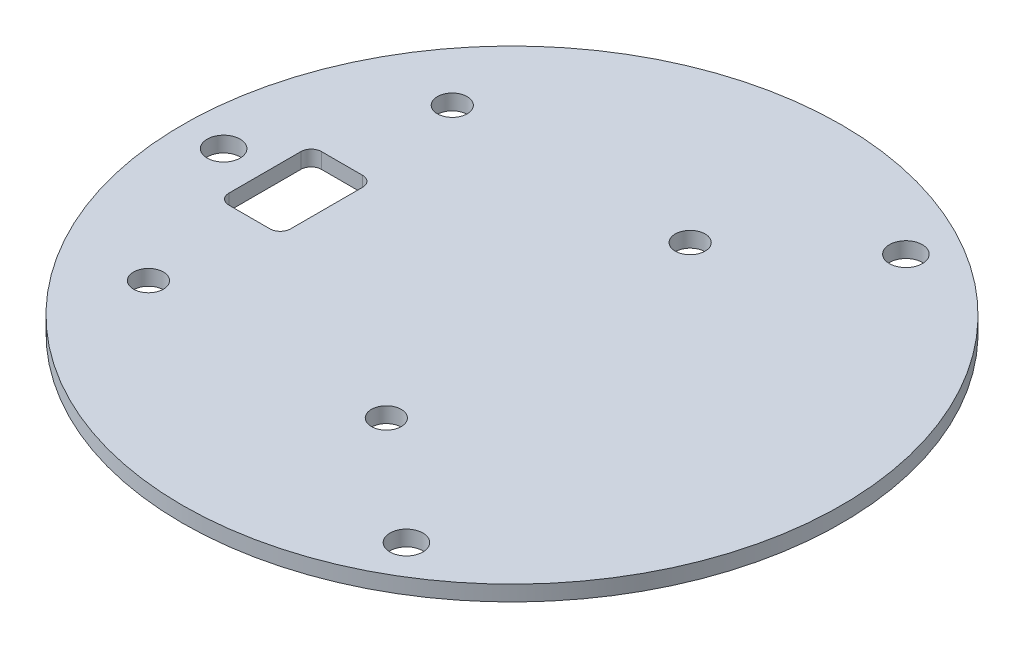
ISO-10303-21;
HEADER;
FILE_DESCRIPTION(('STEP AP214'),'2;1');
FILE_NAME('part.step','',(''),(''),'','','');
FILE_SCHEMA(('AUTOMOTIVE_DESIGN { 1 0 10303 214 1 1 1 1 }'));
ENDSEC;
DATA;
#1=APPLICATION_CONTEXT('core data for automotive mechanical design processes');
#2=APPLICATION_PROTOCOL_DEFINITION('international standard','automotive_design',2000,#1);
#3=PRODUCT_CONTEXT('',#1,'mechanical');
#4=PRODUCT('Part','Part','',(#3));
#5=PRODUCT_RELATED_PRODUCT_CATEGORY('part','',(#4));
#6=PRODUCT_DEFINITION_FORMATION('','',#4);
#7=PRODUCT_DEFINITION_CONTEXT('part definition',#1,'design');
#8=PRODUCT_DEFINITION('design','',#6,#7);
#9=PRODUCT_DEFINITION_SHAPE('','',#8);
#10=(LENGTH_UNIT() NAMED_UNIT(*) SI_UNIT(.MILLI.,.METRE.));
#11=(NAMED_UNIT(*) PLANE_ANGLE_UNIT() SI_UNIT($,.RADIAN.));
#12=(NAMED_UNIT(*) SI_UNIT($,.STERADIAN.) SOLID_ANGLE_UNIT());
#13=UNCERTAINTY_MEASURE_WITH_UNIT(LENGTH_MEASURE(1.E-05),#10,'distance_accuracy_value','');
#14=(GEOMETRIC_REPRESENTATION_CONTEXT(3) GLOBAL_UNCERTAINTY_ASSIGNED_CONTEXT((#13)) GLOBAL_UNIT_ASSIGNED_CONTEXT((#10,
#11,#12)) REPRESENTATION_CONTEXT('',''));
#15=CARTESIAN_POINT('',(0.,0.,0.));
#16=DIRECTION('',(0.,0.,1.));
#17=DIRECTION('',(1.,0.,0.));
#18=AXIS2_PLACEMENT_3D('',#15,#16,#17);
#19=CARTESIAN_POINT('',(0.,-1.5,0.));
#20=DIRECTION('',(0.,1.,0.));
#21=DIRECTION('',(0.,0.,1.));
#22=AXIS2_PLACEMENT_3D('',#19,#20,#21);
#23=CYLINDRICAL_SURFACE('',#22,32.);
#24=CARTESIAN_POINT('',(0.,-1.5,0.));
#25=DIRECTION('',(0.,1.,0.));
#26=DIRECTION('',(0.,0.,1.));
#27=AXIS2_PLACEMENT_3D('',#24,#25,#26);
#28=CIRCLE('',#27,32.);
#29=CARTESIAN_POINT('',(0.,-1.5,32.));
#30=VERTEX_POINT('',#29);
#31=EDGE_CURVE('E171',#30,#30,#28,.T.);
#32=ORIENTED_EDGE('',*,*,#31,.T.);
#33=EDGE_LOOP('',(#32));
#34=FACE_BOUND('',#33,.T.);
#35=CARTESIAN_POINT('',(0.,0.,0.));
#36=DIRECTION('',(0.,1.,0.));
#37=DIRECTION('',(0.,0.,1.));
#38=AXIS2_PLACEMENT_3D('',#35,#36,#37);
#39=CIRCLE('',#38,32.);
#40=CARTESIAN_POINT('',(0.,0.,32.));
#41=VERTEX_POINT('',#40);
#42=EDGE_CURVE('E155',#41,#41,#39,.T.);
#43=ORIENTED_EDGE('',*,*,#42,.F.);
#44=EDGE_LOOP('',(#43));
#45=FACE_BOUND('',#44,.T.);
#46=ADVANCED_FACE('F49',(#34,#45),#23,.T.);
#47=CARTESIAN_POINT('',(0.,-1.5,0.));
#48=DIRECTION('',(0.,1.,0.));
#49=DIRECTION('',(0.,0.,1.));
#50=AXIS2_PLACEMENT_3D('',#47,#48,#49);
#51=PLANE('',#50);
#52=CARTESIAN_POINT('',(-20.55,-1.5,-14.75));
#53=DIRECTION('',(0.,-1.,0.));
#54=DIRECTION('',(0.,0.,-1.));
#55=AXIS2_PLACEMENT_3D('',#52,#53,#54);
#56=CIRCLE('',#55,1.45);
#57=CARTESIAN_POINT('',(-20.55,-1.5,-16.2));
#58=VERTEX_POINT('',#57);
#59=EDGE_CURVE('E228',#58,#58,#56,.T.);
#60=ORIENTED_EDGE('',*,*,#59,.F.);
#61=EDGE_LOOP('',(#60));
#62=FACE_BOUND('',#61,.T.);
#63=CARTESIAN_POINT('',(-20.55,-1.5,14.75));
#64=DIRECTION('',(0.,-1.,0.));
#65=DIRECTION('',(0.,0.,-1.));
#66=AXIS2_PLACEMENT_3D('',#63,#64,#65);
#67=CIRCLE('',#66,1.45);
#68=CARTESIAN_POINT('',(-20.55,-1.5,13.3));
#69=VERTEX_POINT('',#68);
#70=EDGE_CURVE('E234',#69,#69,#67,.T.);
#71=ORIENTED_EDGE('',*,*,#70,.F.);
#72=EDGE_LOOP('',(#71));
#73=FACE_BOUND('',#72,.T.);
#74=CARTESIAN_POINT('',(2.55,-1.5,14.75));
#75=DIRECTION('',(0.,-1.,0.));
#76=DIRECTION('',(0.,0.,-1.));
#77=AXIS2_PLACEMENT_3D('',#74,#75,#76);
#78=CIRCLE('',#77,1.45);
#79=CARTESIAN_POINT('',(2.55,-1.5,13.3));
#80=VERTEX_POINT('',#79);
#81=EDGE_CURVE('E222',#80,#80,#78,.T.);
#82=ORIENTED_EDGE('',*,*,#81,.F.);
#83=EDGE_LOOP('',(#82));
#84=FACE_BOUND('',#83,.T.);
#85=CARTESIAN_POINT('',(2.55,-1.5,-14.75));
#86=DIRECTION('',(0.,-1.,0.));
#87=DIRECTION('',(0.,0.,-1.));
#88=AXIS2_PLACEMENT_3D('',#85,#86,#87);
#89=CIRCLE('',#88,1.45);
#90=CARTESIAN_POINT('',(2.55,-1.5,-16.2));
#91=VERTEX_POINT('',#90);
#92=EDGE_CURVE('E217',#91,#91,#89,.T.);
#93=ORIENTED_EDGE('',*,*,#92,.F.);
#94=EDGE_LOOP('',(#93));
#95=FACE_BOUND('',#94,.T.);
#96=DIRECTION('',(0.,0.,1.));
#97=VECTOR('',#96,1.);
#98=CARTESIAN_POINT('',(-24.,-1.5,-4.5));
#99=LINE('',#98,#97);
#100=CARTESIAN_POINT('',(-24.,-1.5,-3.5));
#101=VERTEX_POINT('',#100);
#102=CARTESIAN_POINT('',(-24.,-1.5,3.5));
#103=VERTEX_POINT('',#102);
#104=EDGE_CURVE('E205',#101,#103,#99,.T.);
#105=ORIENTED_EDGE('',*,*,#104,.T.);
#106=CARTESIAN_POINT('',(-23.,-1.5,3.5));
#107=DIRECTION('',(0.,1.,0.));
#108=DIRECTION('',(0.,0.,1.));
#109=AXIS2_PLACEMENT_3D('',#106,#107,#108);
#110=CIRCLE('',#109,1.);
#111=CARTESIAN_POINT('',(-23.,-1.5,4.5));
#112=VERTEX_POINT('',#111);
#113=EDGE_CURVE('E125',#103,#112,#110,.T.);
#114=ORIENTED_EDGE('',*,*,#113,.T.);
#115=DIRECTION('',(1.,0.,0.));
#116=VECTOR('',#115,1.);
#117=CARTESIAN_POINT('',(-18.,-1.5,4.5));
#118=LINE('',#117,#116);
#119=CARTESIAN_POINT('',(-19.,-1.5,4.5));
#120=VERTEX_POINT('',#119);
#121=EDGE_CURVE('E135',#112,#120,#118,.T.);
#122=ORIENTED_EDGE('',*,*,#121,.T.);
#123=CARTESIAN_POINT('',(-19.,-1.5,3.5));
#124=DIRECTION('',(0.,1.,0.));
#125=DIRECTION('',(0.,0.,1.));
#126=AXIS2_PLACEMENT_3D('',#123,#124,#125);
#127=CIRCLE('',#126,1.);
#128=CARTESIAN_POINT('',(-18.,-1.5,3.5));
#129=VERTEX_POINT('',#128);
#130=EDGE_CURVE('E190',#120,#129,#127,.T.);
#131=ORIENTED_EDGE('',*,*,#130,.T.);
#132=DIRECTION('',(0.,0.,-1.));
#133=VECTOR('',#132,1.);
#134=CARTESIAN_POINT('',(-18.,-1.5,-4.5));
#135=LINE('',#134,#133);
#136=CARTESIAN_POINT('',(-18.,-1.5,-3.5));
#137=VERTEX_POINT('',#136);
#138=EDGE_CURVE('E143',#129,#137,#135,.T.);
#139=ORIENTED_EDGE('',*,*,#138,.T.);
#140=CARTESIAN_POINT('',(-19.,-1.5,-3.5));
#141=DIRECTION('',(0.,1.,0.));
#142=DIRECTION('',(0.,0.,1.));
#143=AXIS2_PLACEMENT_3D('',#140,#141,#142);
#144=CIRCLE('',#143,1.);
#145=CARTESIAN_POINT('',(-19.,-1.5,-4.5));
#146=VERTEX_POINT('',#145);
#147=EDGE_CURVE('E71',#137,#146,#144,.T.);
#148=ORIENTED_EDGE('',*,*,#147,.T.);
#149=DIRECTION('',(-1.,0.,0.));
#150=VECTOR('',#149,1.);
#151=CARTESIAN_POINT('',(-18.,-1.5,-4.5));
#152=LINE('',#151,#150);
#153=CARTESIAN_POINT('',(-23.,-1.5,-4.5));
#154=VERTEX_POINT('',#153);
#155=EDGE_CURVE('E146',#146,#154,#152,.T.);
#156=ORIENTED_EDGE('',*,*,#155,.T.);
#157=CARTESIAN_POINT('',(-23.,-1.5,-3.5));
#158=DIRECTION('',(0.,1.,0.));
#159=DIRECTION('',(0.,0.,1.));
#160=AXIS2_PLACEMENT_3D('',#157,#158,#159);
#161=CIRCLE('',#160,1.);
#162=EDGE_CURVE('E11',#154,#101,#161,.T.);
#163=ORIENTED_EDGE('',*,*,#162,.T.);
#164=EDGE_LOOP('',(#105,#114,#122,#131,#139,#148,#156,#163));
#165=FACE_BOUND('',#164,.T.);
#166=CARTESIAN_POINT('',(-28.,-1.5,0.));
#167=DIRECTION('',(0.,1.,0.));
#168=DIRECTION('',(0.,0.,1.));
#169=AXIS2_PLACEMENT_3D('',#166,#167,#168);
#170=CIRCLE('',#169,1.6);
#171=CARTESIAN_POINT('',(-28.,-1.5,1.6));
#172=VERTEX_POINT('',#171);
#173=EDGE_CURVE('E152',#172,#172,#170,.T.);
#174=ORIENTED_EDGE('',*,*,#173,.T.);
#175=EDGE_LOOP('',(#174));
#176=FACE_BOUND('',#175,.T.);
#177=CARTESIAN_POINT('',(14.,-1.5,-24.2487113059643));
#178=DIRECTION('',(0.,1.,0.));
#179=DIRECTION('',(0.,0.,1.));
#180=AXIS2_PLACEMENT_3D('',#177,#178,#179);
#181=CIRCLE('',#180,1.6);
#182=CARTESIAN_POINT('',(14.,-1.5,-22.6487113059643));
#183=VERTEX_POINT('',#182);
#184=EDGE_CURVE('E162',#183,#183,#181,.T.);
#185=ORIENTED_EDGE('',*,*,#184,.T.);
#186=EDGE_LOOP('',(#185));
#187=FACE_BOUND('',#186,.T.);
#188=CARTESIAN_POINT('',(14.,-1.5,24.2487113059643));
#189=DIRECTION('',(0.,1.,0.));
#190=DIRECTION('',(0.,0.,1.));
#191=AXIS2_PLACEMENT_3D('',#188,#189,#190);
#192=CIRCLE('',#191,1.6);
#193=CARTESIAN_POINT('',(14.,-1.5,25.8487113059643));
#194=VERTEX_POINT('',#193);
#195=EDGE_CURVE('E168',#194,#194,#192,.T.);
#196=ORIENTED_EDGE('',*,*,#195,.T.);
#197=EDGE_LOOP('',(#196));
#198=FACE_BOUND('',#197,.T.);
#199=ORIENTED_EDGE('',*,*,#31,.F.);
#200=EDGE_LOOP('',(#199));
#201=FACE_BOUND('',#200,.T.);
#202=ADVANCED_FACE('F203',(#62,#73,#84,#95,#165,#176,#187,#198,#201),#51,.F.);
#203=CARTESIAN_POINT('',(0.,0.,0.));
#204=DIRECTION('',(0.,1.,0.));
#205=DIRECTION('',(0.,0.,1.));
#206=AXIS2_PLACEMENT_3D('',#203,#204,#205);
#207=PLANE('',#206);
#208=CARTESIAN_POINT('',(-20.55,0.,-14.75));
#209=DIRECTION('',(0.,-1.,0.));
#210=DIRECTION('',(0.,0.,-1.));
#211=AXIS2_PLACEMENT_3D('',#208,#209,#210);
#212=CIRCLE('',#211,1.45);
#213=CARTESIAN_POINT('',(-20.55,0.,-16.2));
#214=VERTEX_POINT('',#213);
#215=EDGE_CURVE('E225',#214,#214,#212,.T.);
#216=ORIENTED_EDGE('',*,*,#215,.T.);
#217=EDGE_LOOP('',(#216));
#218=FACE_BOUND('',#217,.T.);
#219=CARTESIAN_POINT('',(-20.55,0.,14.75));
#220=DIRECTION('',(0.,-1.,0.));
#221=DIRECTION('',(0.,0.,-1.));
#222=AXIS2_PLACEMENT_3D('',#219,#220,#221);
#223=CIRCLE('',#222,1.45);
#224=CARTESIAN_POINT('',(-20.55,0.,13.3));
#225=VERTEX_POINT('',#224);
#226=EDGE_CURVE('E231',#225,#225,#223,.T.);
#227=ORIENTED_EDGE('',*,*,#226,.T.);
#228=EDGE_LOOP('',(#227));
#229=FACE_BOUND('',#228,.T.);
#230=CARTESIAN_POINT('',(2.55,0.,14.75));
#231=DIRECTION('',(0.,-1.,0.));
#232=DIRECTION('',(0.,0.,-1.));
#233=AXIS2_PLACEMENT_3D('',#230,#231,#232);
#234=CIRCLE('',#233,1.45);
#235=CARTESIAN_POINT('',(2.55,0.,13.3));
#236=VERTEX_POINT('',#235);
#237=EDGE_CURVE('E237',#236,#236,#234,.T.);
#238=ORIENTED_EDGE('',*,*,#237,.T.);
#239=EDGE_LOOP('',(#238));
#240=FACE_BOUND('',#239,.T.);
#241=CARTESIAN_POINT('',(2.55,0.,-14.75));
#242=DIRECTION('',(0.,-1.,0.));
#243=DIRECTION('',(0.,0.,-1.));
#244=AXIS2_PLACEMENT_3D('',#241,#242,#243);
#245=CIRCLE('',#244,1.45);
#246=CARTESIAN_POINT('',(2.55,0.,-16.2));
#247=VERTEX_POINT('',#246);
#248=EDGE_CURVE('E213',#247,#247,#245,.T.);
#249=ORIENTED_EDGE('',*,*,#248,.T.);
#250=EDGE_LOOP('',(#249));
#251=FACE_BOUND('',#250,.T.);
#252=DIRECTION('',(0.,0.,-1.));
#253=VECTOR('',#252,1.);
#254=CARTESIAN_POINT('',(-18.,0.,-4.5));
#255=LINE('',#254,#253);
#256=CARTESIAN_POINT('',(-18.,0.,3.5));
#257=VERTEX_POINT('',#256);
#258=CARTESIAN_POINT('',(-18.,0.,-3.5));
#259=VERTEX_POINT('',#258);
#260=EDGE_CURVE('E199',#257,#259,#255,.T.);
#261=ORIENTED_EDGE('',*,*,#260,.F.);
#262=CARTESIAN_POINT('',(-19.,0.,3.5));
#263=DIRECTION('',(0.,1.,0.));
#264=DIRECTION('',(0.,0.,1.));
#265=AXIS2_PLACEMENT_3D('',#262,#263,#264);
#266=CIRCLE('',#265,1.);
#267=CARTESIAN_POINT('',(-19.,0.,4.5));
#268=VERTEX_POINT('',#267);
#269=EDGE_CURVE('E142',#257,#268,#266,.F.);
#270=ORIENTED_EDGE('',*,*,#269,.T.);
#271=DIRECTION('',(1.,0.,0.));
#272=VECTOR('',#271,1.);
#273=CARTESIAN_POINT('',(-18.,0.,4.5));
#274=LINE('',#273,#272);
#275=CARTESIAN_POINT('',(-23.,0.,4.5));
#276=VERTEX_POINT('',#275);
#277=EDGE_CURVE('E132',#276,#268,#274,.T.);
#278=ORIENTED_EDGE('',*,*,#277,.F.);
#279=CARTESIAN_POINT('',(-23.,0.,3.5));
#280=DIRECTION('',(0.,1.,0.));
#281=DIRECTION('',(0.,0.,1.));
#282=AXIS2_PLACEMENT_3D('',#279,#280,#281);
#283=CIRCLE('',#282,1.);
#284=CARTESIAN_POINT('',(-24.,0.,3.5));
#285=VERTEX_POINT('',#284);
#286=EDGE_CURVE('E115',#276,#285,#283,.F.);
#287=ORIENTED_EDGE('',*,*,#286,.T.);
#288=DIRECTION('',(0.,0.,1.));
#289=VECTOR('',#288,1.);
#290=CARTESIAN_POINT('',(-24.,0.,-4.5));
#291=LINE('',#290,#289);
#292=CARTESIAN_POINT('',(-24.,0.,-3.5));
#293=VERTEX_POINT('',#292);
#294=EDGE_CURVE('E144',#293,#285,#291,.T.);
#295=ORIENTED_EDGE('',*,*,#294,.F.);
#296=CARTESIAN_POINT('',(-23.,0.,-3.5));
#297=DIRECTION('',(0.,1.,0.));
#298=DIRECTION('',(0.,0.,1.));
#299=AXIS2_PLACEMENT_3D('',#296,#297,#298);
#300=CIRCLE('',#299,1.);
#301=CARTESIAN_POINT('',(-23.,0.,-4.5));
#302=VERTEX_POINT('',#301);
#303=EDGE_CURVE('E57',#293,#302,#300,.F.);
#304=ORIENTED_EDGE('',*,*,#303,.T.);
#305=DIRECTION('',(-1.,0.,0.));
#306=VECTOR('',#305,1.);
#307=CARTESIAN_POINT('',(-18.,0.,-4.5));
#308=LINE('',#307,#306);
#309=CARTESIAN_POINT('',(-19.,0.,-4.5));
#310=VERTEX_POINT('',#309);
#311=EDGE_CURVE('E148',#310,#302,#308,.T.);
#312=ORIENTED_EDGE('',*,*,#311,.F.);
#313=CARTESIAN_POINT('',(-19.,0.,-3.5));
#314=DIRECTION('',(0.,1.,0.));
#315=DIRECTION('',(0.,0.,1.));
#316=AXIS2_PLACEMENT_3D('',#313,#314,#315);
#317=CIRCLE('',#316,1.);
#318=EDGE_CURVE('E192',#310,#259,#317,.F.);
#319=ORIENTED_EDGE('',*,*,#318,.T.);
#320=EDGE_LOOP('',(#261,#270,#278,#287,#295,#304,#312,#319));
#321=FACE_BOUND('',#320,.T.);
#322=CARTESIAN_POINT('',(-28.,0.,0.));
#323=DIRECTION('',(0.,1.,0.));
#324=DIRECTION('',(0.,0.,1.));
#325=AXIS2_PLACEMENT_3D('',#322,#323,#324);
#326=CIRCLE('',#325,1.6);
#327=CARTESIAN_POINT('',(-28.,0.,1.6));
#328=VERTEX_POINT('',#327);
#329=EDGE_CURVE('E156',#328,#328,#326,.T.);
#330=ORIENTED_EDGE('',*,*,#329,.F.);
#331=EDGE_LOOP('',(#330));
#332=FACE_BOUND('',#331,.T.);
#333=CARTESIAN_POINT('',(14.,0.,-24.2487113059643));
#334=DIRECTION('',(0.,1.,0.));
#335=DIRECTION('',(0.,0.,1.));
#336=AXIS2_PLACEMENT_3D('',#333,#334,#335);
#337=CIRCLE('',#336,1.6);
#338=CARTESIAN_POINT('',(14.,0.,-22.6487113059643));
#339=VERTEX_POINT('',#338);
#340=EDGE_CURVE('E159',#339,#339,#337,.T.);
#341=ORIENTED_EDGE('',*,*,#340,.F.);
#342=EDGE_LOOP('',(#341));
#343=FACE_BOUND('',#342,.T.);
#344=CARTESIAN_POINT('',(14.,0.,24.2487113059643));
#345=DIRECTION('',(0.,1.,0.));
#346=DIRECTION('',(0.,0.,1.));
#347=AXIS2_PLACEMENT_3D('',#344,#345,#346);
#348=CIRCLE('',#347,1.6);
#349=CARTESIAN_POINT('',(14.,0.,25.8487113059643));
#350=VERTEX_POINT('',#349);
#351=EDGE_CURVE('E165',#350,#350,#348,.T.);
#352=ORIENTED_EDGE('',*,*,#351,.F.);
#353=EDGE_LOOP('',(#352));
#354=FACE_BOUND('',#353,.T.);
#355=ORIENTED_EDGE('',*,*,#42,.T.);
#356=EDGE_LOOP('',(#355));
#357=FACE_BOUND('',#356,.T.);
#358=ADVANCED_FACE('F140',(#218,#229,#240,#251,#321,#332,#343,#354,#357),#207,.T.);
#359=CARTESIAN_POINT('',(14.,-1.5,24.2487113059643));
#360=DIRECTION('',(0.,1.,0.));
#361=DIRECTION('',(0.,0.,1.));
#362=AXIS2_PLACEMENT_3D('',#359,#360,#361);
#363=CYLINDRICAL_SURFACE('',#362,1.6);
#364=ORIENTED_EDGE('',*,*,#195,.F.);
#365=EDGE_LOOP('',(#364));
#366=FACE_BOUND('',#365,.T.);
#367=ORIENTED_EDGE('',*,*,#351,.T.);
#368=EDGE_LOOP('',(#367));
#369=FACE_BOUND('',#368,.T.);
#370=ADVANCED_FACE('F303',(#366,#369),#363,.F.);
#371=CARTESIAN_POINT('',(14.,-1.5,-24.2487113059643));
#372=DIRECTION('',(0.,1.,0.));
#373=DIRECTION('',(0.,0.,1.));
#374=AXIS2_PLACEMENT_3D('',#371,#372,#373);
#375=CYLINDRICAL_SURFACE('',#374,1.6);
#376=ORIENTED_EDGE('',*,*,#184,.F.);
#377=EDGE_LOOP('',(#376));
#378=FACE_BOUND('',#377,.T.);
#379=ORIENTED_EDGE('',*,*,#340,.T.);
#380=EDGE_LOOP('',(#379));
#381=FACE_BOUND('',#380,.T.);
#382=ADVANCED_FACE('F295',(#378,#381),#375,.F.);
#383=CARTESIAN_POINT('',(-28.,-1.5,0.));
#384=DIRECTION('',(0.,1.,0.));
#385=DIRECTION('',(0.,0.,1.));
#386=AXIS2_PLACEMENT_3D('',#383,#384,#385);
#387=CYLINDRICAL_SURFACE('',#386,1.6);
#388=ORIENTED_EDGE('',*,*,#173,.F.);
#389=EDGE_LOOP('',(#388));
#390=FACE_BOUND('',#389,.T.);
#391=ORIENTED_EDGE('',*,*,#329,.T.);
#392=EDGE_LOOP('',(#391));
#393=FACE_BOUND('',#392,.T.);
#394=ADVANCED_FACE('F289',(#390,#393),#387,.F.);
#395=CARTESIAN_POINT('',(-18.,-1.5,-4.5));
#396=DIRECTION('',(1.,0.,0.));
#397=DIRECTION('',(0.,0.,-1.));
#398=AXIS2_PLACEMENT_3D('',#395,#396,#397);
#399=PLANE('',#398);
#400=ORIENTED_EDGE('',*,*,#138,.F.);
#401=DIRECTION('',(0.,1.,0.));
#402=VECTOR('',#401,1.);
#403=CARTESIAN_POINT('',(-18.,0.,3.5));
#404=LINE('',#403,#402);
#405=EDGE_CURVE('E182',#129,#257,#404,.T.);
#406=ORIENTED_EDGE('',*,*,#405,.T.);
#407=ORIENTED_EDGE('',*,*,#260,.T.);
#408=DIRECTION('',(0.,1.,0.));
#409=VECTOR('',#408,1.);
#410=CARTESIAN_POINT('',(-18.,-1.5,-3.5));
#411=LINE('',#410,#409);
#412=EDGE_CURVE('E180',#259,#137,#411,.F.);
#413=ORIENTED_EDGE('',*,*,#412,.T.);
#414=EDGE_LOOP('',(#400,#406,#407,#413));
#415=FACE_BOUND('',#414,.T.);
#416=ADVANCED_FACE('F285',(#415),#399,.F.);
#417=CARTESIAN_POINT('',(-18.,-1.5,4.5));
#418=DIRECTION('',(0.,0.,1.));
#419=DIRECTION('',(1.,0.,0.));
#420=AXIS2_PLACEMENT_3D('',#417,#418,#419);
#421=PLANE('',#420);
#422=ORIENTED_EDGE('',*,*,#121,.F.);
#423=DIRECTION('',(0.,1.,0.));
#424=VECTOR('',#423,1.);
#425=CARTESIAN_POINT('',(-23.,0.,4.5));
#426=LINE('',#425,#424);
#427=EDGE_CURVE('E119',#112,#276,#426,.T.);
#428=ORIENTED_EDGE('',*,*,#427,.T.);
#429=ORIENTED_EDGE('',*,*,#277,.T.);
#430=DIRECTION('',(0.,1.,0.));
#431=VECTOR('',#430,1.);
#432=CARTESIAN_POINT('',(-19.,-1.5,4.5));
#433=LINE('',#432,#431);
#434=EDGE_CURVE('E137',#268,#120,#433,.F.);
#435=ORIENTED_EDGE('',*,*,#434,.T.);
#436=EDGE_LOOP('',(#422,#428,#429,#435));
#437=FACE_BOUND('',#436,.T.);
#438=ADVANCED_FACE('F131',(#437),#421,.F.);
#439=CARTESIAN_POINT('',(-24.,-1.5,-4.5));
#440=DIRECTION('',(-1.,0.,0.));
#441=DIRECTION('',(0.,0.,1.));
#442=AXIS2_PLACEMENT_3D('',#439,#440,#441);
#443=PLANE('',#442);
#444=ORIENTED_EDGE('',*,*,#294,.T.);
#445=DIRECTION('',(0.,1.,0.));
#446=VECTOR('',#445,1.);
#447=CARTESIAN_POINT('',(-24.,-1.5,3.5));
#448=LINE('',#447,#446);
#449=EDGE_CURVE('E120',#285,#103,#448,.F.);
#450=ORIENTED_EDGE('',*,*,#449,.T.);
#451=ORIENTED_EDGE('',*,*,#104,.F.);
#452=DIRECTION('',(0.,1.,0.));
#453=VECTOR('',#452,1.);
#454=CARTESIAN_POINT('',(-24.,0.,-3.5));
#455=LINE('',#454,#453);
#456=EDGE_CURVE('E136',#101,#293,#455,.T.);
#457=ORIENTED_EDGE('',*,*,#456,.T.);
#458=EDGE_LOOP('',(#444,#450,#451,#457));
#459=FACE_BOUND('',#458,.T.);
#460=ADVANCED_FACE('F207',(#459),#443,.F.);
#461=CARTESIAN_POINT('',(-18.,-1.5,-4.5));
#462=DIRECTION('',(0.,0.,-1.));
#463=DIRECTION('',(-1.,0.,0.));
#464=AXIS2_PLACEMENT_3D('',#461,#462,#463);
#465=PLANE('',#464);
#466=ORIENTED_EDGE('',*,*,#155,.F.);
#467=DIRECTION('',(0.,1.,0.));
#468=VECTOR('',#467,1.);
#469=CARTESIAN_POINT('',(-19.,0.,-4.5));
#470=LINE('',#469,#468);
#471=EDGE_CURVE('E126',#146,#310,#470,.T.);
#472=ORIENTED_EDGE('',*,*,#471,.T.);
#473=ORIENTED_EDGE('',*,*,#311,.T.);
#474=DIRECTION('',(0.,1.,0.));
#475=VECTOR('',#474,1.);
#476=CARTESIAN_POINT('',(-23.,-1.5,-4.5));
#477=LINE('',#476,#475);
#478=EDGE_CURVE('E64',#302,#154,#477,.F.);
#479=ORIENTED_EDGE('',*,*,#478,.T.);
#480=EDGE_LOOP('',(#466,#472,#473,#479));
#481=FACE_BOUND('',#480,.T.);
#482=ADVANCED_FACE('F197',(#481),#465,.F.);
#483=CARTESIAN_POINT('',(-23.,-1.5,3.5));
#484=DIRECTION('',(0.,-1.,0.));
#485=DIRECTION('',(0.,0.,-1.));
#486=AXIS2_PLACEMENT_3D('',#483,#484,#485);
#487=CYLINDRICAL_SURFACE('',#486,1.);
#488=ORIENTED_EDGE('',*,*,#113,.F.);
#489=ORIENTED_EDGE('',*,*,#449,.F.);
#490=ORIENTED_EDGE('',*,*,#286,.F.);
#491=ORIENTED_EDGE('',*,*,#427,.F.);
#492=EDGE_LOOP('',(#488,#489,#490,#491));
#493=FACE_BOUND('',#492,.T.);
#494=ADVANCED_FACE('F118',(#493),#487,.F.);
#495=CARTESIAN_POINT('',(-19.,-1.5,3.5));
#496=DIRECTION('',(0.,-1.,0.));
#497=DIRECTION('',(0.,0.,-1.));
#498=AXIS2_PLACEMENT_3D('',#495,#496,#497);
#499=CYLINDRICAL_SURFACE('',#498,1.);
#500=ORIENTED_EDGE('',*,*,#130,.F.);
#501=ORIENTED_EDGE('',*,*,#434,.F.);
#502=ORIENTED_EDGE('',*,*,#269,.F.);
#503=ORIENTED_EDGE('',*,*,#405,.F.);
#504=EDGE_LOOP('',(#500,#501,#502,#503));
#505=FACE_BOUND('',#504,.T.);
#506=ADVANCED_FACE('F277',(#505),#499,.F.);
#507=CARTESIAN_POINT('',(-19.,-1.5,-3.5));
#508=DIRECTION('',(0.,-1.,0.));
#509=DIRECTION('',(0.,0.,-1.));
#510=AXIS2_PLACEMENT_3D('',#507,#508,#509);
#511=CYLINDRICAL_SURFACE('',#510,1.);
#512=ORIENTED_EDGE('',*,*,#147,.F.);
#513=ORIENTED_EDGE('',*,*,#412,.F.);
#514=ORIENTED_EDGE('',*,*,#318,.F.);
#515=ORIENTED_EDGE('',*,*,#471,.F.);
#516=EDGE_LOOP('',(#512,#513,#514,#515));
#517=FACE_BOUND('',#516,.T.);
#518=ADVANCED_FACE('F263',(#517),#511,.F.);
#519=CARTESIAN_POINT('',(-23.,-1.5,-3.5));
#520=DIRECTION('',(0.,-1.,0.));
#521=DIRECTION('',(0.,0.,-1.));
#522=AXIS2_PLACEMENT_3D('',#519,#520,#521);
#523=CYLINDRICAL_SURFACE('',#522,1.);
#524=ORIENTED_EDGE('',*,*,#162,.F.);
#525=ORIENTED_EDGE('',*,*,#478,.F.);
#526=ORIENTED_EDGE('',*,*,#303,.F.);
#527=ORIENTED_EDGE('',*,*,#456,.F.);
#528=EDGE_LOOP('',(#524,#525,#526,#527));
#529=FACE_BOUND('',#528,.T.);
#530=ADVANCED_FACE('F51',(#529),#523,.F.);
#531=CARTESIAN_POINT('',(2.55,0.,-14.75));
#532=DIRECTION('',(0.,-1.,0.));
#533=DIRECTION('',(0.,0.,-1.));
#534=AXIS2_PLACEMENT_3D('',#531,#532,#533);
#535=CYLINDRICAL_SURFACE('',#534,1.45);
#536=ORIENTED_EDGE('',*,*,#248,.F.);
#537=EDGE_LOOP('',(#536));
#538=FACE_BOUND('',#537,.T.);
#539=ORIENTED_EDGE('',*,*,#92,.T.);
#540=EDGE_LOOP('',(#539));
#541=FACE_BOUND('',#540,.T.);
#542=ADVANCED_FACE('F251',(#538,#541),#535,.F.);
#543=CARTESIAN_POINT('',(2.55,0.,14.75));
#544=DIRECTION('',(0.,-1.,0.));
#545=DIRECTION('',(0.,0.,-1.));
#546=AXIS2_PLACEMENT_3D('',#543,#544,#545);
#547=CYLINDRICAL_SURFACE('',#546,1.45);
#548=ORIENTED_EDGE('',*,*,#237,.F.);
#549=EDGE_LOOP('',(#548));
#550=FACE_BOUND('',#549,.T.);
#551=ORIENTED_EDGE('',*,*,#81,.T.);
#552=EDGE_LOOP('',(#551));
#553=FACE_BOUND('',#552,.T.);
#554=ADVANCED_FACE('F243',(#550,#553),#547,.F.);
#555=CARTESIAN_POINT('',(-20.55,0.,14.75));
#556=DIRECTION('',(0.,-1.,0.));
#557=DIRECTION('',(0.,0.,-1.));
#558=AXIS2_PLACEMENT_3D('',#555,#556,#557);
#559=CYLINDRICAL_SURFACE('',#558,1.45);
#560=ORIENTED_EDGE('',*,*,#226,.F.);
#561=EDGE_LOOP('',(#560));
#562=FACE_BOUND('',#561,.T.);
#563=ORIENTED_EDGE('',*,*,#70,.T.);
#564=EDGE_LOOP('',(#563));
#565=FACE_BOUND('',#564,.T.);
#566=ADVANCED_FACE('F259',(#562,#565),#559,.F.);
#567=CARTESIAN_POINT('',(-20.55,0.,-14.75));
#568=DIRECTION('',(0.,-1.,0.));
#569=DIRECTION('',(0.,0.,-1.));
#570=AXIS2_PLACEMENT_3D('',#567,#568,#569);
#571=CYLINDRICAL_SURFACE('',#570,1.45);
#572=ORIENTED_EDGE('',*,*,#215,.F.);
#573=EDGE_LOOP('',(#572));
#574=FACE_BOUND('',#573,.T.);
#575=ORIENTED_EDGE('',*,*,#59,.T.);
#576=EDGE_LOOP('',(#575));
#577=FACE_BOUND('',#576,.T.);
#578=ADVANCED_FACE('F328',(#574,#577),#571,.F.);
#579=CLOSED_SHELL('',(#46,#202,#358,#370,#382,#394,#416,#438,#460,#482,#494,#506,#518,#530,#542,
#554,#566,#578));
#580=MANIFOLD_SOLID_BREP('B2',#579);
#581=ADVANCED_BREP_SHAPE_REPRESENTATION('',(#18,#580),#14);
#582=SHAPE_DEFINITION_REPRESENTATION(#9,#581);
ENDSEC;
END-ISO-10303-21;
